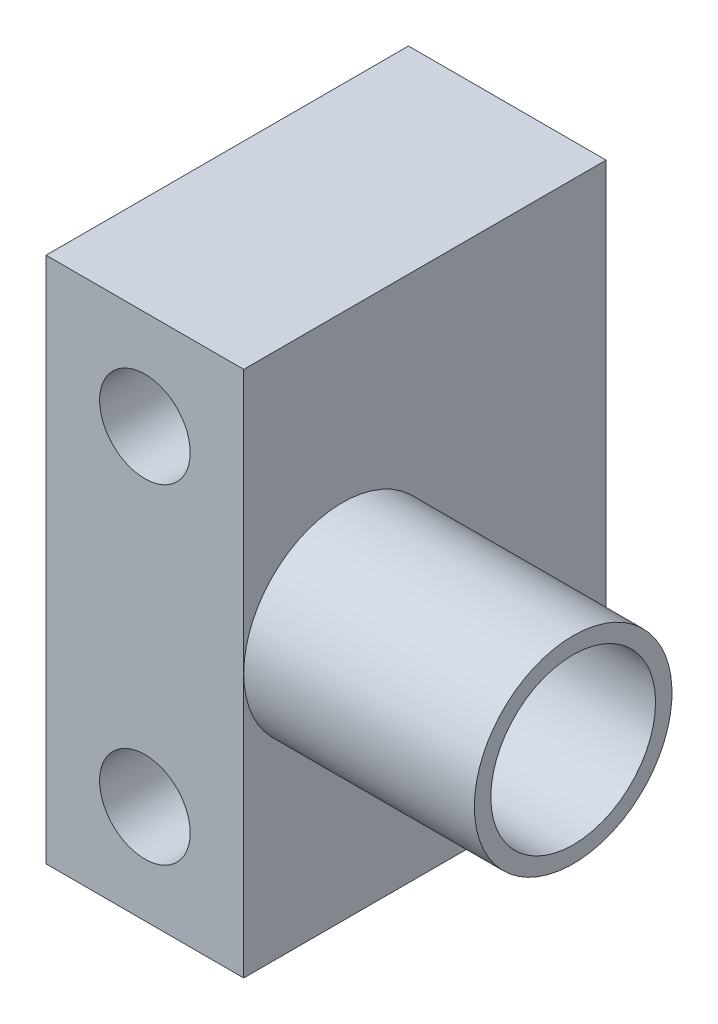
ISO-10303-21;
HEADER;
FILE_DESCRIPTION(('STEP AP214'),'2;1');
FILE_NAME('part.step','',(''),(''),'','','');
FILE_SCHEMA(('AUTOMOTIVE_DESIGN { 1 0 10303 214 1 1 1 1 }'));
ENDSEC;
DATA;
#1=APPLICATION_CONTEXT('core data for automotive mechanical design processes');
#2=APPLICATION_PROTOCOL_DEFINITION('international standard','automotive_design',2000,#1);
#3=PRODUCT_CONTEXT('',#1,'mechanical');
#4=PRODUCT('Part','Part','',(#3));
#5=PRODUCT_RELATED_PRODUCT_CATEGORY('part','',(#4));
#6=PRODUCT_DEFINITION_FORMATION('','',#4);
#7=PRODUCT_DEFINITION_CONTEXT('part definition',#1,'design');
#8=PRODUCT_DEFINITION('design','',#6,#7);
#9=PRODUCT_DEFINITION_SHAPE('','',#8);
#10=(LENGTH_UNIT() NAMED_UNIT(*) SI_UNIT(.MILLI.,.METRE.));
#11=(NAMED_UNIT(*) PLANE_ANGLE_UNIT() SI_UNIT($,.RADIAN.));
#12=(NAMED_UNIT(*) SI_UNIT($,.STERADIAN.) SOLID_ANGLE_UNIT());
#13=UNCERTAINTY_MEASURE_WITH_UNIT(LENGTH_MEASURE(1.E-05),#10,'distance_accuracy_value','');
#14=(GEOMETRIC_REPRESENTATION_CONTEXT(3) GLOBAL_UNCERTAINTY_ASSIGNED_CONTEXT((#13)) GLOBAL_UNIT_ASSIGNED_CONTEXT((#10,
#11,#12)) REPRESENTATION_CONTEXT('',''));
#15=CARTESIAN_POINT('',(0.,0.,0.));
#16=DIRECTION('',(0.,0.,1.));
#17=DIRECTION('',(1.,0.,0.));
#18=AXIS2_PLACEMENT_3D('',#15,#16,#17);
#19=CARTESIAN_POINT('',(6.,26.,22.));
#20=DIRECTION('',(-1.,0.,0.));
#21=DIRECTION('',(0.,-1.,0.));
#22=AXIS2_PLACEMENT_3D('',#19,#20,#21);
#23=PLANE('',#22);
#24=DIRECTION('',(0.,1.,0.));
#25=VECTOR('',#24,1.);
#26=CARTESIAN_POINT('',(6.,26.,22.));
#27=LINE('',#26,#25);
#28=CARTESIAN_POINT('',(6.,10.,22.));
#29=VERTEX_POINT('',#28);
#30=CARTESIAN_POINT('',(6.,26.,22.));
#31=VERTEX_POINT('',#30);
#32=EDGE_CURVE('E60',#29,#31,#27,.T.);
#33=ORIENTED_EDGE('',*,*,#32,.F.);
#34=CARTESIAN_POINT('',(6.,10.,16.));
#35=DIRECTION('',(1.,0.,0.));
#36=DIRECTION('',(0.,1.,0.));
#37=AXIS2_PLACEMENT_3D('',#34,#35,#36);
#38=CIRCLE('',#37,6.);
#39=EDGE_CURVE('E69',#29,#29,#38,.T.);
#40=ORIENTED_EDGE('',*,*,#39,.F.);
#41=CARTESIAN_POINT('',(6.,-6.,22.));
#42=VERTEX_POINT('',#41);
#43=EDGE_CURVE('E56',#42,#29,#27,.T.);
#44=ORIENTED_EDGE('',*,*,#43,.F.);
#45=DIRECTION('',(0.,0.,-1.));
#46=VECTOR('',#45,1.);
#47=CARTESIAN_POINT('',(6.,-6.,22.));
#48=LINE('',#47,#46);
#49=CARTESIAN_POINT('',(6.,-6.,0.));
#50=VERTEX_POINT('',#49);
#51=EDGE_CURVE('E79',#42,#50,#48,.T.);
#52=ORIENTED_EDGE('',*,*,#51,.T.);
#53=DIRECTION('',(0.,1.,0.));
#54=VECTOR('',#53,1.);
#55=CARTESIAN_POINT('',(6.,26.,0.));
#56=LINE('',#55,#54);
#57=CARTESIAN_POINT('',(6.,26.,0.));
#58=VERTEX_POINT('',#57);
#59=EDGE_CURVE('E96',#50,#58,#56,.T.);
#60=ORIENTED_EDGE('',*,*,#59,.T.);
#61=DIRECTION('',(0.,0.,-1.));
#62=VECTOR('',#61,1.);
#63=CARTESIAN_POINT('',(6.,26.,22.));
#64=LINE('',#63,#62);
#65=EDGE_CURVE('E10',#31,#58,#64,.T.);
#66=ORIENTED_EDGE('',*,*,#65,.F.);
#67=EDGE_LOOP('',(#33,#40,#44,#52,#60,#66));
#68=FACE_BOUND('',#67,.T.);
#69=ADVANCED_FACE('F15',(#68),#23,.F.);
#70=CARTESIAN_POINT('',(6.,26.,22.));
#71=DIRECTION('',(0.,0.,-1.));
#72=DIRECTION('',(-1.,0.,0.));
#73=AXIS2_PLACEMENT_3D('',#70,#71,#72);
#74=PLANE('',#73);
#75=CARTESIAN_POINT('',(0.,20.,22.));
#76=DIRECTION('',(0.,0.,1.));
#77=DIRECTION('',(1.,0.,0.));
#78=AXIS2_PLACEMENT_3D('',#75,#76,#77);
#79=CIRCLE('',#78,2.75);
#80=CARTESIAN_POINT('',(2.75,20.,22.));
#81=VERTEX_POINT('',#80);
#82=EDGE_CURVE('E100',#81,#81,#79,.T.);
#83=ORIENTED_EDGE('',*,*,#82,.F.);
#84=EDGE_LOOP('',(#83));
#85=FACE_BOUND('',#84,.T.);
#86=ORIENTED_EDGE('',*,*,#43,.T.);
#87=ORIENTED_EDGE('',*,*,#32,.T.);
#88=DIRECTION('',(-1.,0.,0.));
#89=VECTOR('',#88,1.);
#90=CARTESIAN_POINT('',(6.,26.,22.));
#91=LINE('',#90,#89);
#92=CARTESIAN_POINT('',(-6.,26.,22.));
#93=VERTEX_POINT('',#92);
#94=EDGE_CURVE('E65',#31,#93,#91,.T.);
#95=ORIENTED_EDGE('',*,*,#94,.T.);
#96=DIRECTION('',(0.,-1.,0.));
#97=VECTOR('',#96,1.);
#98=CARTESIAN_POINT('',(-6.,26.,22.));
#99=LINE('',#98,#97);
#100=CARTESIAN_POINT('',(-6.,-6.,22.));
#101=VERTEX_POINT('',#100);
#102=EDGE_CURVE('E35',#93,#101,#99,.T.);
#103=ORIENTED_EDGE('',*,*,#102,.T.);
#104=DIRECTION('',(1.,0.,0.));
#105=VECTOR('',#104,1.);
#106=CARTESIAN_POINT('',(6.,-6.,22.));
#107=LINE('',#106,#105);
#108=EDGE_CURVE('E30',#101,#42,#107,.T.);
#109=ORIENTED_EDGE('',*,*,#108,.T.);
#110=EDGE_LOOP('',(#86,#87,#95,#103,#109));
#111=FACE_BOUND('',#110,.T.);
#112=CARTESIAN_POINT('',(0.,0.,22.));
#113=DIRECTION('',(0.,0.,1.));
#114=DIRECTION('',(1.,0.,0.));
#115=AXIS2_PLACEMENT_3D('',#112,#113,#114);
#116=CIRCLE('',#115,2.75);
#117=CARTESIAN_POINT('',(2.75,0.,22.));
#118=VERTEX_POINT('',#117);
#119=EDGE_CURVE('E106',#118,#118,#116,.T.);
#120=ORIENTED_EDGE('',*,*,#119,.F.);
#121=EDGE_LOOP('',(#120));
#122=FACE_BOUND('',#121,.T.);
#123=ADVANCED_FACE('F58',(#85,#111,#122),#74,.F.);
#124=CARTESIAN_POINT('',(6.,26.,0.));
#125=DIRECTION('',(0.,0.,-1.));
#126=DIRECTION('',(-1.,0.,0.));
#127=AXIS2_PLACEMENT_3D('',#124,#125,#126);
#128=PLANE('',#127);
#129=CARTESIAN_POINT('',(0.,20.,0.));
#130=DIRECTION('',(0.,0.,1.));
#131=DIRECTION('',(1.,0.,0.));
#132=AXIS2_PLACEMENT_3D('',#129,#130,#131);
#133=CIRCLE('',#132,2.75);
#134=CARTESIAN_POINT('',(2.75,20.,0.));
#135=VERTEX_POINT('',#134);
#136=EDGE_CURVE('E103',#135,#135,#133,.T.);
#137=ORIENTED_EDGE('',*,*,#136,.T.);
#138=EDGE_LOOP('',(#137));
#139=FACE_BOUND('',#138,.T.);
#140=ORIENTED_EDGE('',*,*,#59,.F.);
#141=DIRECTION('',(1.,0.,0.));
#142=VECTOR('',#141,1.);
#143=CARTESIAN_POINT('',(6.,-6.,0.));
#144=LINE('',#143,#142);
#145=CARTESIAN_POINT('',(-6.,-6.,0.));
#146=VERTEX_POINT('',#145);
#147=EDGE_CURVE('E71',#146,#50,#144,.T.);
#148=ORIENTED_EDGE('',*,*,#147,.F.);
#149=DIRECTION('',(0.,-1.,0.));
#150=VECTOR('',#149,1.);
#151=CARTESIAN_POINT('',(-6.,26.,0.));
#152=LINE('',#151,#150);
#153=CARTESIAN_POINT('',(-6.,26.,0.));
#154=VERTEX_POINT('',#153);
#155=EDGE_CURVE('E72',#154,#146,#152,.T.);
#156=ORIENTED_EDGE('',*,*,#155,.F.);
#157=DIRECTION('',(-1.,0.,0.));
#158=VECTOR('',#157,1.);
#159=CARTESIAN_POINT('',(6.,26.,0.));
#160=LINE('',#159,#158);
#161=EDGE_CURVE('E95',#58,#154,#160,.T.);
#162=ORIENTED_EDGE('',*,*,#161,.F.);
#163=EDGE_LOOP('',(#140,#148,#156,#162));
#164=FACE_BOUND('',#163,.T.);
#165=CARTESIAN_POINT('',(0.,0.,0.));
#166=DIRECTION('',(0.,0.,1.));
#167=DIRECTION('',(1.,0.,0.));
#168=AXIS2_PLACEMENT_3D('',#165,#166,#167);
#169=CIRCLE('',#168,2.75);
#170=CARTESIAN_POINT('',(2.75,0.,0.));
#171=VERTEX_POINT('',#170);
#172=EDGE_CURVE('E109',#171,#171,#169,.T.);
#173=ORIENTED_EDGE('',*,*,#172,.T.);
#174=EDGE_LOOP('',(#173));
#175=FACE_BOUND('',#174,.T.);
#176=ADVANCED_FACE('F93',(#139,#164,#175),#128,.T.);
#177=CARTESIAN_POINT('',(6.,26.,22.));
#178=DIRECTION('',(0.,-1.,0.));
#179=DIRECTION('',(1.,0.,0.));
#180=AXIS2_PLACEMENT_3D('',#177,#178,#179);
#181=PLANE('',#180);
#182=ORIENTED_EDGE('',*,*,#161,.T.);
#183=DIRECTION('',(0.,0.,-1.));
#184=VECTOR('',#183,1.);
#185=CARTESIAN_POINT('',(-6.,26.,22.));
#186=LINE('',#185,#184);
#187=EDGE_CURVE('E23',#93,#154,#186,.T.);
#188=ORIENTED_EDGE('',*,*,#187,.F.);
#189=ORIENTED_EDGE('',*,*,#94,.F.);
#190=ORIENTED_EDGE('',*,*,#65,.T.);
#191=EDGE_LOOP('',(#182,#188,#189,#190));
#192=FACE_BOUND('',#191,.T.);
#193=ADVANCED_FACE('F160',(#192),#181,.F.);
#194=CARTESIAN_POINT('',(-6.,26.,22.));
#195=DIRECTION('',(1.,0.,0.));
#196=DIRECTION('',(0.,1.,0.));
#197=AXIS2_PLACEMENT_3D('',#194,#195,#196);
#198=PLANE('',#197);
#199=CARTESIAN_POINT('',(-6.,10.,16.));
#200=DIRECTION('',(-1.,0.,0.));
#201=DIRECTION('',(0.,-1.,0.));
#202=AXIS2_PLACEMENT_3D('',#199,#200,#201);
#203=CIRCLE('',#202,3.25);
#204=CARTESIAN_POINT('',(-6.,6.75,16.));
#205=VERTEX_POINT('',#204);
#206=EDGE_CURVE('E116',#205,#205,#203,.T.);
#207=ORIENTED_EDGE('',*,*,#206,.F.);
#208=EDGE_LOOP('',(#207));
#209=FACE_BOUND('',#208,.T.);
#210=ORIENTED_EDGE('',*,*,#155,.T.);
#211=DIRECTION('',(0.,0.,-1.));
#212=VECTOR('',#211,1.);
#213=CARTESIAN_POINT('',(-6.,-6.,22.));
#214=LINE('',#213,#212);
#215=EDGE_CURVE('E81',#101,#146,#214,.T.);
#216=ORIENTED_EDGE('',*,*,#215,.F.);
#217=ORIENTED_EDGE('',*,*,#102,.F.);
#218=ORIENTED_EDGE('',*,*,#187,.T.);
#219=EDGE_LOOP('',(#210,#216,#217,#218));
#220=FACE_BOUND('',#219,.T.);
#221=ADVANCED_FACE('F88',(#209,#220),#198,.F.);
#222=CARTESIAN_POINT('',(6.,-6.,22.));
#223=DIRECTION('',(0.,1.,0.));
#224=DIRECTION('',(-1.,0.,0.));
#225=AXIS2_PLACEMENT_3D('',#222,#223,#224);
#226=PLANE('',#225);
#227=ORIENTED_EDGE('',*,*,#147,.T.);
#228=ORIENTED_EDGE('',*,*,#51,.F.);
#229=ORIENTED_EDGE('',*,*,#108,.F.);
#230=ORIENTED_EDGE('',*,*,#215,.T.);
#231=EDGE_LOOP('',(#227,#228,#229,#230));
#232=FACE_BOUND('',#231,.T.);
#233=ADVANCED_FACE('F166',(#232),#226,.F.);
#234=CARTESIAN_POINT('',(0.,20.,22.));
#235=DIRECTION('',(0.,0.,-1.));
#236=DIRECTION('',(-1.,0.,0.));
#237=AXIS2_PLACEMENT_3D('',#234,#235,#236);
#238=CYLINDRICAL_SURFACE('',#237,2.75);
#239=ORIENTED_EDGE('',*,*,#82,.T.);
#240=EDGE_LOOP('',(#239));
#241=FACE_BOUND('',#240,.T.);
#242=ORIENTED_EDGE('',*,*,#136,.F.);
#243=EDGE_LOOP('',(#242));
#244=FACE_BOUND('',#243,.T.);
#245=ADVANCED_FACE('F146',(#241,#244),#238,.F.);
#246=CARTESIAN_POINT('',(0.,0.,22.));
#247=DIRECTION('',(0.,0.,-1.));
#248=DIRECTION('',(-1.,0.,0.));
#249=AXIS2_PLACEMENT_3D('',#246,#247,#248);
#250=CYLINDRICAL_SURFACE('',#249,2.75);
#251=ORIENTED_EDGE('',*,*,#119,.T.);
#252=EDGE_LOOP('',(#251));
#253=FACE_BOUND('',#252,.T.);
#254=ORIENTED_EDGE('',*,*,#172,.F.);
#255=EDGE_LOOP('',(#254));
#256=FACE_BOUND('',#255,.T.);
#257=ADVANCED_FACE('F139',(#253,#256),#250,.F.);
#258=CARTESIAN_POINT('',(20.,10.,16.));
#259=DIRECTION('',(-1.,0.,0.));
#260=DIRECTION('',(0.,-1.,0.));
#261=AXIS2_PLACEMENT_3D('',#258,#259,#260);
#262=CYLINDRICAL_SURFACE('',#261,6.);
#263=CARTESIAN_POINT('',(20.,10.,16.));
#264=DIRECTION('',(1.,0.,0.));
#265=DIRECTION('',(0.,1.,0.));
#266=AXIS2_PLACEMENT_3D('',#263,#264,#265);
#267=CIRCLE('',#266,6.);
#268=CARTESIAN_POINT('',(20.,16.,16.));
#269=VERTEX_POINT('',#268);
#270=EDGE_CURVE('E112',#269,#269,#267,.T.);
#271=ORIENTED_EDGE('',*,*,#270,.F.);
#272=EDGE_LOOP('',(#271));
#273=FACE_BOUND('',#272,.T.);
#274=ORIENTED_EDGE('',*,*,#39,.T.);
#275=EDGE_LOOP('',(#274));
#276=FACE_BOUND('',#275,.T.);
#277=ADVANCED_FACE('F133',(#273,#276),#262,.T.);
#278=CARTESIAN_POINT('',(20.,10.,16.));
#279=DIRECTION('',(1.,0.,0.));
#280=DIRECTION('',(0.,1.,0.));
#281=AXIS2_PLACEMENT_3D('',#278,#279,#280);
#282=PLANE('',#281);
#283=CARTESIAN_POINT('',(20.,10.,16.));
#284=DIRECTION('',(1.,0.,0.));
#285=DIRECTION('',(0.,1.,0.));
#286=AXIS2_PLACEMENT_3D('',#283,#284,#285);
#287=CIRCLE('',#286,5.);
#288=CARTESIAN_POINT('',(20.,15.,16.));
#289=VERTEX_POINT('',#288);
#290=EDGE_CURVE('E122',#289,#289,#287,.T.);
#291=ORIENTED_EDGE('',*,*,#290,.F.);
#292=EDGE_LOOP('',(#291));
#293=FACE_BOUND('',#292,.T.);
#294=ORIENTED_EDGE('',*,*,#270,.T.);
#295=EDGE_LOOP('',(#294));
#296=FACE_BOUND('',#295,.T.);
#297=ADVANCED_FACE('F129',(#293,#296),#282,.T.);
#298=CARTESIAN_POINT('',(20.,10.,16.));
#299=DIRECTION('',(-1.,0.,0.));
#300=DIRECTION('',(0.,-1.,0.));
#301=AXIS2_PLACEMENT_3D('',#298,#299,#300);
#302=CYLINDRICAL_SURFACE('',#301,3.25);
#303=CARTESIAN_POINT('',(7.,10.,16.));
#304=DIRECTION('',(-1.,0.,0.));
#305=DIRECTION('',(0.,-1.,0.));
#306=AXIS2_PLACEMENT_3D('',#303,#304,#305);
#307=CIRCLE('',#306,3.25);
#308=CARTESIAN_POINT('',(7.,6.75,16.));
#309=VERTEX_POINT('',#308);
#310=EDGE_CURVE('E18',#309,#309,#307,.F.);
#311=ORIENTED_EDGE('',*,*,#310,.T.);
#312=EDGE_LOOP('',(#311));
#313=FACE_BOUND('',#312,.T.);
#314=ORIENTED_EDGE('',*,*,#206,.T.);
#315=EDGE_LOOP('',(#314));
#316=FACE_BOUND('',#315,.T.);
#317=ADVANCED_FACE('F132',(#313,#316),#302,.F.);
#318=CARTESIAN_POINT('',(7.,26.,22.));
#319=DIRECTION('',(-1.,0.,0.));
#320=DIRECTION('',(0.,-1.,0.));
#321=AXIS2_PLACEMENT_3D('',#318,#319,#320);
#322=PLANE('',#321);
#323=CARTESIAN_POINT('',(7.,10.,16.));
#324=DIRECTION('',(-1.,0.,0.));
#325=DIRECTION('',(0.,-1.,0.));
#326=AXIS2_PLACEMENT_3D('',#323,#324,#325);
#327=CIRCLE('',#326,5.);
#328=CARTESIAN_POINT('',(7.,5.,16.));
#329=VERTEX_POINT('',#328);
#330=EDGE_CURVE('E119',#329,#329,#327,.F.);
#331=ORIENTED_EDGE('',*,*,#330,.T.);
#332=EDGE_LOOP('',(#331));
#333=FACE_BOUND('',#332,.T.);
#334=ORIENTED_EDGE('',*,*,#310,.F.);
#335=EDGE_LOOP('',(#334));
#336=FACE_BOUND('',#335,.T.);
#337=ADVANCED_FACE('F239',(#333,#336),#322,.F.);
#338=CARTESIAN_POINT('',(-8.14213562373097,10.,16.));
#339=DIRECTION('',(1.,0.,0.));
#340=DIRECTION('',(0.,1.,0.));
#341=AXIS2_PLACEMENT_3D('',#338,#339,#340);
#342=CYLINDRICAL_SURFACE('',#341,5.);
#343=ORIENTED_EDGE('',*,*,#290,.T.);
#344=EDGE_LOOP('',(#343));
#345=FACE_BOUND('',#344,.T.);
#346=ORIENTED_EDGE('',*,*,#330,.F.);
#347=EDGE_LOOP('',(#346));
#348=FACE_BOUND('',#347,.T.);
#349=ADVANCED_FACE('F126',(#345,#348),#342,.F.);
#350=CLOSED_SHELL('',(#69,#123,#176,#193,#221,#233,#245,#257,#277,#297,#317,#337,#349));
#351=MANIFOLD_SOLID_BREP('B1',#350);
#352=ADVANCED_BREP_SHAPE_REPRESENTATION('',(#18,#351),#14);
#353=SHAPE_DEFINITION_REPRESENTATION(#9,#352);
ENDSEC;
END-ISO-10303-21;
